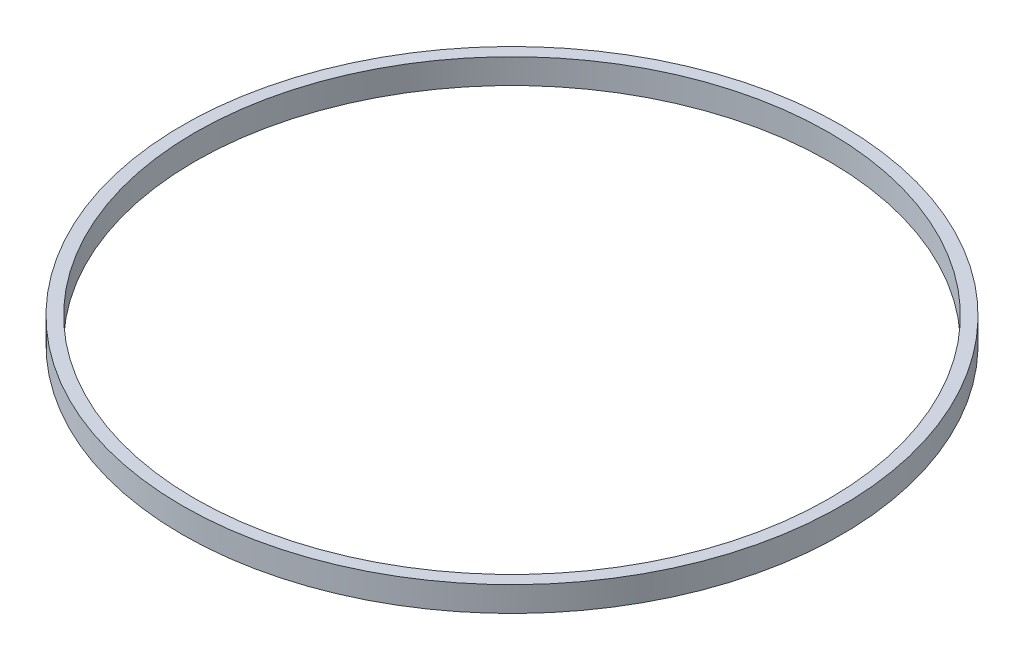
from build123d import *

# Parameters (mm, degrees)
SKETCH1_R           = 13.2
SKETCH1_R_2         = 12.7
BOSS_EXTRUDE1_DEPTH = 1


with BuildPart() as part:
    # Sketch1 → Boss-Extrude1 (new body)
    with BuildSketch(Plane(origin=(0, 0, 0), x_dir=(1, 0, 0), z_dir=(0, 1, 0))):
        with Locations(Location((0, 0, 0), (0, 0, 270))):
            Circle(SKETCH1_R)
        with Locations(Location((0, 0, 0), (0, 0, 270))):
            Circle(SKETCH1_R_2, mode=Mode.SUBTRACT)
    extrude(amount=BOSS_EXTRUDE1_DEPTH)


solid = part.part
